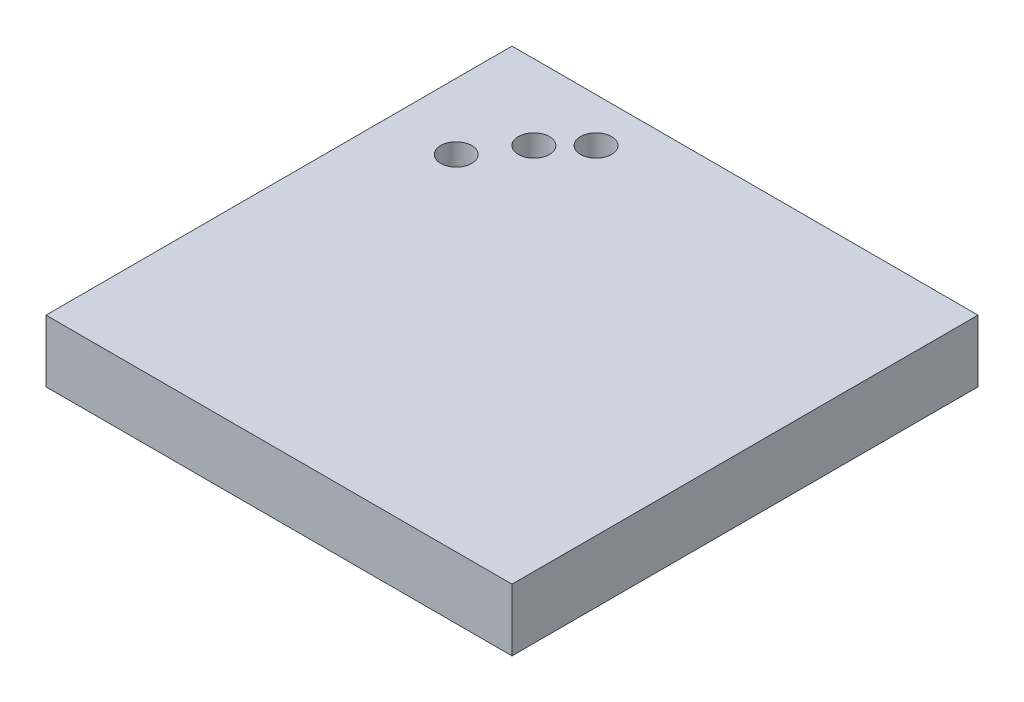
ISO-10303-21;
HEADER;
FILE_DESCRIPTION(('STEP AP214'),'2;1');
FILE_NAME('part.step','',(''),(''),'','','');
FILE_SCHEMA(('AUTOMOTIVE_DESIGN { 1 0 10303 214 1 1 1 1 }'));
ENDSEC;
DATA;
#1=APPLICATION_CONTEXT('core data for automotive mechanical design processes');
#2=APPLICATION_PROTOCOL_DEFINITION('international standard','automotive_design',2000,#1);
#3=PRODUCT_CONTEXT('',#1,'mechanical');
#4=PRODUCT('Part','Part','',(#3));
#5=PRODUCT_RELATED_PRODUCT_CATEGORY('part','',(#4));
#6=PRODUCT_DEFINITION_FORMATION('','',#4);
#7=PRODUCT_DEFINITION_CONTEXT('part definition',#1,'design');
#8=PRODUCT_DEFINITION('design','',#6,#7);
#9=PRODUCT_DEFINITION_SHAPE('','',#8);
#10=(LENGTH_UNIT() NAMED_UNIT(*) SI_UNIT(.MILLI.,.METRE.));
#11=(NAMED_UNIT(*) PLANE_ANGLE_UNIT() SI_UNIT($,.RADIAN.));
#12=(NAMED_UNIT(*) SI_UNIT($,.STERADIAN.) SOLID_ANGLE_UNIT());
#13=UNCERTAINTY_MEASURE_WITH_UNIT(LENGTH_MEASURE(1.E-05),#10,'distance_accuracy_value','');
#14=(GEOMETRIC_REPRESENTATION_CONTEXT(3) GLOBAL_UNCERTAINTY_ASSIGNED_CONTEXT((#13)) GLOBAL_UNIT_ASSIGNED_CONTEXT((#10,
#11,#12)) REPRESENTATION_CONTEXT('',''));
#15=CARTESIAN_POINT('',(0.,0.,0.));
#16=DIRECTION('',(0.,0.,1.));
#17=DIRECTION('',(1.,0.,0.));
#18=AXIS2_PLACEMENT_3D('',#15,#16,#17);
#19=CARTESIAN_POINT('',(-75.,20.,-75.));
#20=DIRECTION('',(1.,0.,0.));
#21=DIRECTION('',(0.,0.,-1.));
#22=AXIS2_PLACEMENT_3D('',#19,#20,#21);
#23=PLANE('',#22);
#24=DIRECTION('',(0.,0.,1.));
#25=VECTOR('',#24,1.);
#26=CARTESIAN_POINT('',(-75.,0.,-75.));
#27=LINE('',#26,#25);
#28=CARTESIAN_POINT('',(-75.,0.,-75.));
#29=VERTEX_POINT('',#28);
#30=CARTESIAN_POINT('',(-75.,0.,75.));
#31=VERTEX_POINT('',#30);
#32=EDGE_CURVE('E84',#29,#31,#27,.T.);
#33=ORIENTED_EDGE('',*,*,#32,.T.);
#34=DIRECTION('',(0.,-1.,0.));
#35=VECTOR('',#34,1.);
#36=CARTESIAN_POINT('',(-75.,20.,75.));
#37=LINE('',#36,#35);
#38=CARTESIAN_POINT('',(-75.,20.,75.));
#39=VERTEX_POINT('',#38);
#40=EDGE_CURVE('E11',#39,#31,#37,.T.);
#41=ORIENTED_EDGE('',*,*,#40,.F.);
#42=DIRECTION('',(0.,0.,1.));
#43=VECTOR('',#42,1.);
#44=CARTESIAN_POINT('',(-75.,20.,-75.));
#45=LINE('',#44,#43);
#46=CARTESIAN_POINT('',(-75.,20.,-75.));
#47=VERTEX_POINT('',#46);
#48=EDGE_CURVE('E112',#47,#39,#45,.T.);
#49=ORIENTED_EDGE('',*,*,#48,.F.);
#50=DIRECTION('',(0.,-1.,0.));
#51=VECTOR('',#50,1.);
#52=CARTESIAN_POINT('',(-75.,20.,-75.));
#53=LINE('',#52,#51);
#54=EDGE_CURVE('E97',#47,#29,#53,.T.);
#55=ORIENTED_EDGE('',*,*,#54,.T.);
#56=EDGE_LOOP('',(#33,#41,#49,#55));
#57=FACE_BOUND('',#56,.T.);
#58=ADVANCED_FACE('F39',(#57),#23,.F.);
#59=CARTESIAN_POINT('',(-75.,20.,75.));
#60=DIRECTION('',(0.,0.,-1.));
#61=DIRECTION('',(-1.,0.,0.));
#62=AXIS2_PLACEMENT_3D('',#59,#60,#61);
#63=PLANE('',#62);
#64=DIRECTION('',(1.,0.,0.));
#65=VECTOR('',#64,1.);
#66=CARTESIAN_POINT('',(-75.,0.,75.));
#67=LINE('',#66,#65);
#68=CARTESIAN_POINT('',(75.,0.,75.));
#69=VERTEX_POINT('',#68);
#70=EDGE_CURVE('E80',#31,#69,#67,.T.);
#71=ORIENTED_EDGE('',*,*,#70,.T.);
#72=DIRECTION('',(0.,-1.,0.));
#73=VECTOR('',#72,1.);
#74=CARTESIAN_POINT('',(75.,20.,75.));
#75=LINE('',#74,#73);
#76=CARTESIAN_POINT('',(75.,20.,75.));
#77=VERTEX_POINT('',#76);
#78=EDGE_CURVE('E47',#77,#69,#75,.T.);
#79=ORIENTED_EDGE('',*,*,#78,.F.);
#80=DIRECTION('',(1.,0.,0.));
#81=VECTOR('',#80,1.);
#82=CARTESIAN_POINT('',(-75.,20.,75.));
#83=LINE('',#82,#81);
#84=EDGE_CURVE('E93',#39,#77,#83,.T.);
#85=ORIENTED_EDGE('',*,*,#84,.F.);
#86=ORIENTED_EDGE('',*,*,#40,.T.);
#87=EDGE_LOOP('',(#71,#79,#85,#86));
#88=FACE_BOUND('',#87,.T.);
#89=ADVANCED_FACE('F92',(#88),#63,.F.);
#90=CARTESIAN_POINT('',(75.,20.,-75.));
#91=DIRECTION('',(-1.,0.,0.));
#92=DIRECTION('',(0.,0.,1.));
#93=AXIS2_PLACEMENT_3D('',#90,#91,#92);
#94=PLANE('',#93);
#95=DIRECTION('',(0.,0.,-1.));
#96=VECTOR('',#95,1.);
#97=CARTESIAN_POINT('',(75.,0.,-75.));
#98=LINE('',#97,#96);
#99=CARTESIAN_POINT('',(75.,0.,-75.));
#100=VERTEX_POINT('',#99);
#101=EDGE_CURVE('E85',#69,#100,#98,.T.);
#102=ORIENTED_EDGE('',*,*,#101,.T.);
#103=DIRECTION('',(0.,-1.,0.));
#104=VECTOR('',#103,1.);
#105=CARTESIAN_POINT('',(75.,20.,-75.));
#106=LINE('',#105,#104);
#107=CARTESIAN_POINT('',(75.,20.,-75.));
#108=VERTEX_POINT('',#107);
#109=EDGE_CURVE('E123',#108,#100,#106,.T.);
#110=ORIENTED_EDGE('',*,*,#109,.F.);
#111=DIRECTION('',(0.,0.,-1.));
#112=VECTOR('',#111,1.);
#113=CARTESIAN_POINT('',(75.,20.,-75.));
#114=LINE('',#113,#112);
#115=EDGE_CURVE('E59',#77,#108,#114,.T.);
#116=ORIENTED_EDGE('',*,*,#115,.F.);
#117=ORIENTED_EDGE('',*,*,#78,.T.);
#118=EDGE_LOOP('',(#102,#110,#116,#117));
#119=FACE_BOUND('',#118,.T.);
#120=ADVANCED_FACE('F128',(#119),#94,.F.);
#121=CARTESIAN_POINT('',(-75.,20.,-75.));
#122=DIRECTION('',(0.,0.,1.));
#123=DIRECTION('',(1.,0.,0.));
#124=AXIS2_PLACEMENT_3D('',#121,#122,#123);
#125=PLANE('',#124);
#126=DIRECTION('',(-1.,0.,0.));
#127=VECTOR('',#126,1.);
#128=CARTESIAN_POINT('',(-75.,0.,-75.));
#129=LINE('',#128,#127);
#130=EDGE_CURVE('E109',#100,#29,#129,.T.);
#131=ORIENTED_EDGE('',*,*,#130,.T.);
#132=ORIENTED_EDGE('',*,*,#54,.F.);
#133=DIRECTION('',(-1.,0.,0.));
#134=VECTOR('',#133,1.);
#135=CARTESIAN_POINT('',(-75.,20.,-75.));
#136=LINE('',#135,#134);
#137=EDGE_CURVE('E54',#108,#47,#136,.T.);
#138=ORIENTED_EDGE('',*,*,#137,.F.);
#139=ORIENTED_EDGE('',*,*,#109,.T.);
#140=EDGE_LOOP('',(#131,#132,#138,#139));
#141=FACE_BOUND('',#140,.T.);
#142=ADVANCED_FACE('F130',(#141),#125,.F.);
#143=CARTESIAN_POINT('',(-75.,20.,75.));
#144=DIRECTION('',(0.,1.,0.));
#145=DIRECTION('',(0.,0.,1.));
#146=AXIS2_PLACEMENT_3D('',#143,#144,#145);
#147=PLANE('',#146);
#148=CARTESIAN_POINT('',(-53.76,20.,-35.81));
#149=DIRECTION('',(0.,1.,0.));
#150=DIRECTION('',(0.,0.,1.));
#151=AXIS2_PLACEMENT_3D('',#148,#149,#150);
#152=CIRCLE('',#151,5.);
#153=CARTESIAN_POINT('',(-53.76,20.,-30.81));
#154=VERTEX_POINT('',#153);
#155=EDGE_CURVE('E236',#154,#154,#152,.T.);
#156=ORIENTED_EDGE('',*,*,#155,.F.);
#157=EDGE_LOOP('',(#156));
#158=FACE_BOUND('',#157,.T.);
#159=CARTESIAN_POINT('',(-43.76,20.,-50.81));
#160=DIRECTION('',(0.,1.,0.));
#161=DIRECTION('',(0.,0.,1.));
#162=AXIS2_PLACEMENT_3D('',#159,#160,#161);
#163=CIRCLE('',#162,5.);
#164=CARTESIAN_POINT('',(-43.76,20.,-45.81));
#165=VERTEX_POINT('',#164);
#166=EDGE_CURVE('E235',#165,#165,#163,.T.);
#167=ORIENTED_EDGE('',*,*,#166,.F.);
#168=EDGE_LOOP('',(#167));
#169=FACE_BOUND('',#168,.T.);
#170=CARTESIAN_POINT('',(-33.76,20.,-60.81));
#171=DIRECTION('',(0.,1.,0.));
#172=DIRECTION('',(0.,0.,1.));
#173=AXIS2_PLACEMENT_3D('',#170,#171,#172);
#174=CIRCLE('',#173,5.);
#175=CARTESIAN_POINT('',(-33.76,20.,-55.81));
#176=VERTEX_POINT('',#175);
#177=EDGE_CURVE('E103',#176,#176,#174,.T.);
#178=ORIENTED_EDGE('',*,*,#177,.F.);
#179=EDGE_LOOP('',(#178));
#180=FACE_BOUND('',#179,.T.);
#181=ORIENTED_EDGE('',*,*,#48,.T.);
#182=ORIENTED_EDGE('',*,*,#84,.T.);
#183=ORIENTED_EDGE('',*,*,#115,.T.);
#184=ORIENTED_EDGE('',*,*,#137,.T.);
#185=EDGE_LOOP('',(#181,#182,#183,#184));
#186=FACE_BOUND('',#185,.T.);
#187=ADVANCED_FACE('F131',(#158,#169,#180,#186),#147,.T.);
#188=CARTESIAN_POINT('',(-75.,0.,75.));
#189=DIRECTION('',(0.,1.,0.));
#190=DIRECTION('',(0.,0.,1.));
#191=AXIS2_PLACEMENT_3D('',#188,#189,#190);
#192=PLANE('',#191);
#193=ORIENTED_EDGE('',*,*,#32,.F.);
#194=ORIENTED_EDGE('',*,*,#130,.F.);
#195=ORIENTED_EDGE('',*,*,#101,.F.);
#196=ORIENTED_EDGE('',*,*,#70,.F.);
#197=EDGE_LOOP('',(#193,#194,#195,#196));
#198=FACE_BOUND('',#197,.T.);
#199=ADVANCED_FACE('F81',(#198),#192,.F.);
#200=CARTESIAN_POINT('',(-33.76,10.,-60.81));
#201=DIRECTION('',(0.,1.,0.));
#202=DIRECTION('',(0.,0.,1.));
#203=AXIS2_PLACEMENT_3D('',#200,#201,#202);
#204=CYLINDRICAL_SURFACE('',#203,5.);
#205=CARTESIAN_POINT('',(-33.76,10.,-60.81));
#206=DIRECTION('',(0.,1.,0.));
#207=DIRECTION('',(0.,0.,1.));
#208=AXIS2_PLACEMENT_3D('',#205,#206,#207);
#209=CIRCLE('',#208,5.);
#210=CARTESIAN_POINT('',(-33.76,10.,-55.81));
#211=VERTEX_POINT('',#210);
#212=EDGE_CURVE('E99',#211,#211,#209,.T.);
#213=ORIENTED_EDGE('',*,*,#212,.F.);
#214=EDGE_LOOP('',(#213));
#215=FACE_BOUND('',#214,.T.);
#216=ORIENTED_EDGE('',*,*,#177,.T.);
#217=EDGE_LOOP('',(#216));
#218=FACE_BOUND('',#217,.T.);
#219=ADVANCED_FACE('F139',(#215,#218),#204,.F.);
#220=CARTESIAN_POINT('',(-33.76,10.,-60.81));
#221=DIRECTION('',(0.,1.,0.));
#222=DIRECTION('',(0.,0.,1.));
#223=AXIS2_PLACEMENT_3D('',#220,#221,#222);
#224=PLANE('',#223);
#225=ORIENTED_EDGE('',*,*,#212,.T.);
#226=EDGE_LOOP('',(#225));
#227=FACE_BOUND('',#226,.T.);
#228=ADVANCED_FACE('F174',(#227),#224,.T.);
#229=CARTESIAN_POINT('',(-43.76,10.,-50.81));
#230=DIRECTION('',(0.,1.,0.));
#231=DIRECTION('',(0.,0.,1.));
#232=AXIS2_PLACEMENT_3D('',#229,#230,#231);
#233=CYLINDRICAL_SURFACE('',#232,5.);
#234=CARTESIAN_POINT('',(-43.76,10.,-50.81));
#235=DIRECTION('',(0.,1.,0.));
#236=DIRECTION('',(0.,0.,1.));
#237=AXIS2_PLACEMENT_3D('',#234,#235,#236);
#238=CIRCLE('',#237,5.);
#239=CARTESIAN_POINT('',(-43.76,10.,-45.81));
#240=VERTEX_POINT('',#239);
#241=EDGE_CURVE('E241',#240,#240,#238,.T.);
#242=ORIENTED_EDGE('',*,*,#241,.F.);
#243=EDGE_LOOP('',(#242));
#244=FACE_BOUND('',#243,.T.);
#245=ORIENTED_EDGE('',*,*,#166,.T.);
#246=EDGE_LOOP('',(#245));
#247=FACE_BOUND('',#246,.T.);
#248=ADVANCED_FACE('F183',(#244,#247),#233,.F.);
#249=CARTESIAN_POINT('',(-43.76,10.,-50.81));
#250=DIRECTION('',(0.,1.,0.));
#251=DIRECTION('',(0.,0.,1.));
#252=AXIS2_PLACEMENT_3D('',#249,#250,#251);
#253=PLANE('',#252);
#254=ORIENTED_EDGE('',*,*,#241,.T.);
#255=EDGE_LOOP('',(#254));
#256=FACE_BOUND('',#255,.T.);
#257=ADVANCED_FACE('F197',(#256),#253,.T.);
#258=CARTESIAN_POINT('',(-53.76,10.,-35.81));
#259=DIRECTION('',(0.,1.,0.));
#260=DIRECTION('',(0.,0.,1.));
#261=AXIS2_PLACEMENT_3D('',#258,#259,#260);
#262=CYLINDRICAL_SURFACE('',#261,5.);
#263=CARTESIAN_POINT('',(-53.76,10.,-35.81));
#264=DIRECTION('',(0.,1.,0.));
#265=DIRECTION('',(0.,0.,1.));
#266=AXIS2_PLACEMENT_3D('',#263,#264,#265);
#267=CIRCLE('',#266,5.);
#268=CARTESIAN_POINT('',(-53.76,10.,-30.81));
#269=VERTEX_POINT('',#268);
#270=EDGE_CURVE('E233',#269,#269,#267,.T.);
#271=ORIENTED_EDGE('',*,*,#270,.F.);
#272=EDGE_LOOP('',(#271));
#273=FACE_BOUND('',#272,.T.);
#274=ORIENTED_EDGE('',*,*,#155,.T.);
#275=EDGE_LOOP('',(#274));
#276=FACE_BOUND('',#275,.T.);
#277=ADVANCED_FACE('F207',(#273,#276),#262,.F.);
#278=CARTESIAN_POINT('',(-53.76,10.,-35.81));
#279=DIRECTION('',(0.,1.,0.));
#280=DIRECTION('',(0.,0.,1.));
#281=AXIS2_PLACEMENT_3D('',#278,#279,#280);
#282=PLANE('',#281);
#283=ORIENTED_EDGE('',*,*,#270,.T.);
#284=EDGE_LOOP('',(#283));
#285=FACE_BOUND('',#284,.T.);
#286=ADVANCED_FACE('F217',(#285),#282,.T.);
#287=CLOSED_SHELL('',(#58,#89,#120,#142,#187,#199,#219,#228,#248,#257,#277,#286));
#288=MANIFOLD_SOLID_BREP('B2',#287);
#289=ADVANCED_BREP_SHAPE_REPRESENTATION('',(#18,#288),#14);
#290=SHAPE_DEFINITION_REPRESENTATION(#9,#289);
ENDSEC;
END-ISO-10303-21;
